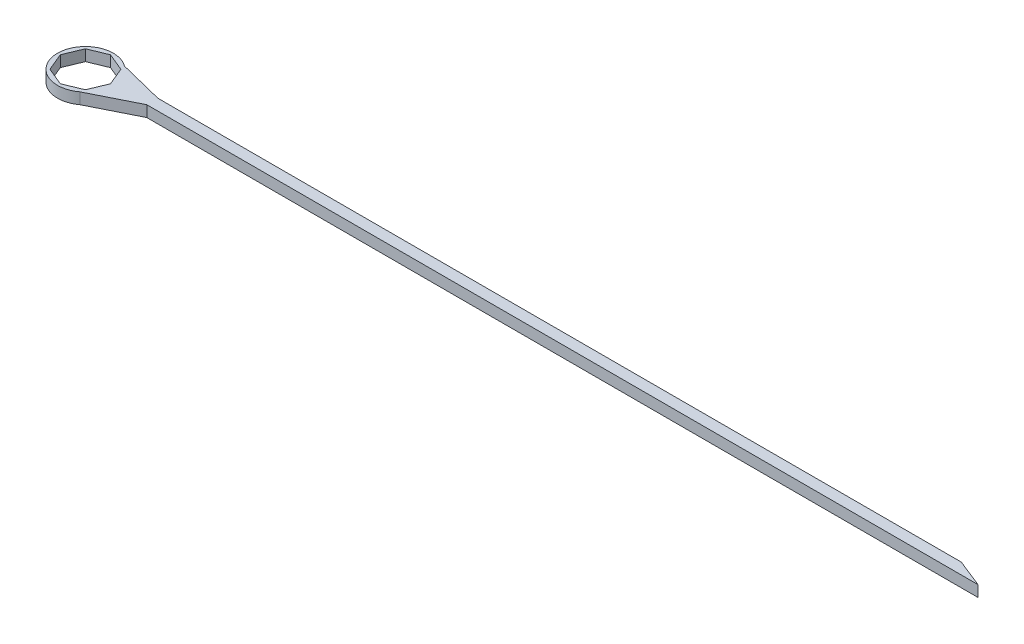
from build123d import *

# Parameters (mm, degrees)
BOSS_EXTRUDE1_DEPTH = 1


with BuildPart() as part:
    # Sketch1 → Boss-Extrude1 (new body)
    with BuildSketch(Plane(origin=(0, 0, 0), x_dir=(1, 0, 0), z_dir=(0, 1, 0))):
        with BuildLine():
            Line((5.5, 0), (80, 0))
            Line((80, 0), (77.5, 1))
            Line((77.5, 1), (5.5, 1))
            Line((5.5, 1), (1.5, 2))
            ThreePointArc((1.5, 2), (-2.5, 0), (1.5, -2))
            Line((1.5, -2), (5.5, 0))
        make_face()
        Polygon((2.25, 0), (1.590990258, 1.590990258), (0, 2.25), (-1.590990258, 1.590990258), (-2.25, 0), (-1.590990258, -1.590990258), (0, -2.25), (1.590990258, -1.590990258), align=None, mode=Mode.SUBTRACT)
    extrude(amount=BOSS_EXTRUDE1_DEPTH)


solid = part.part
